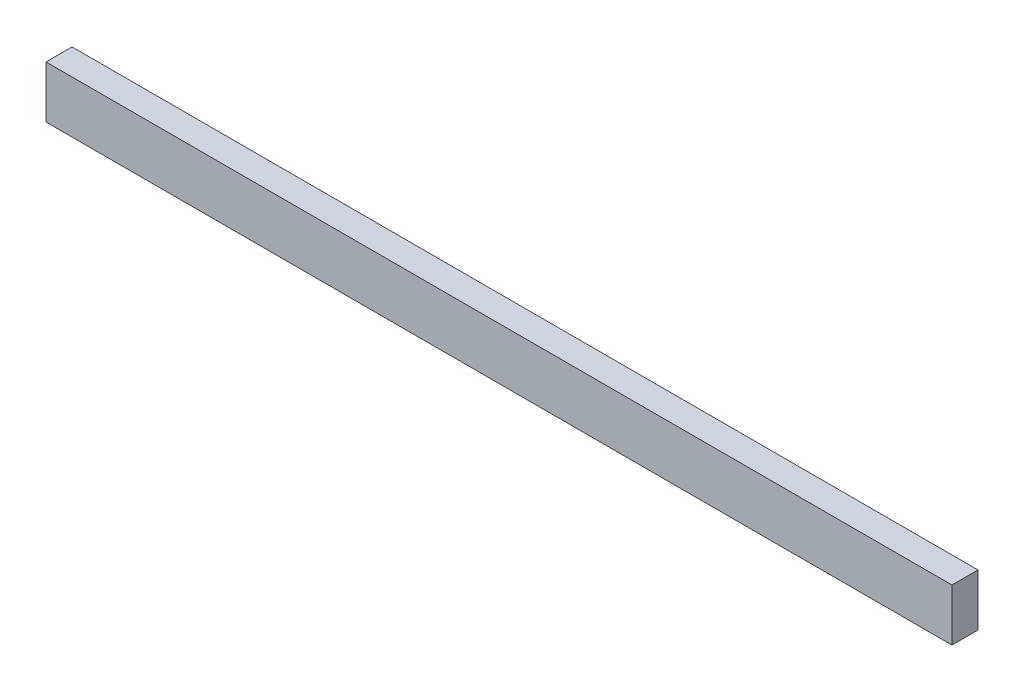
from build123d import *

# Parameters (mm, degrees)
SKETCH1_W           = 870
SKETCH1_H           = 50
BOSS_EXTRUDE1_DEPTH = 25


with BuildPart() as part:
    # Sketch1 → Boss-Extrude1 (new body)
    with BuildSketch(Plane.XY):
        Rectangle(SKETCH1_W, SKETCH1_H)
    extrude(amount=BOSS_EXTRUDE1_DEPTH)


solid = part.part
